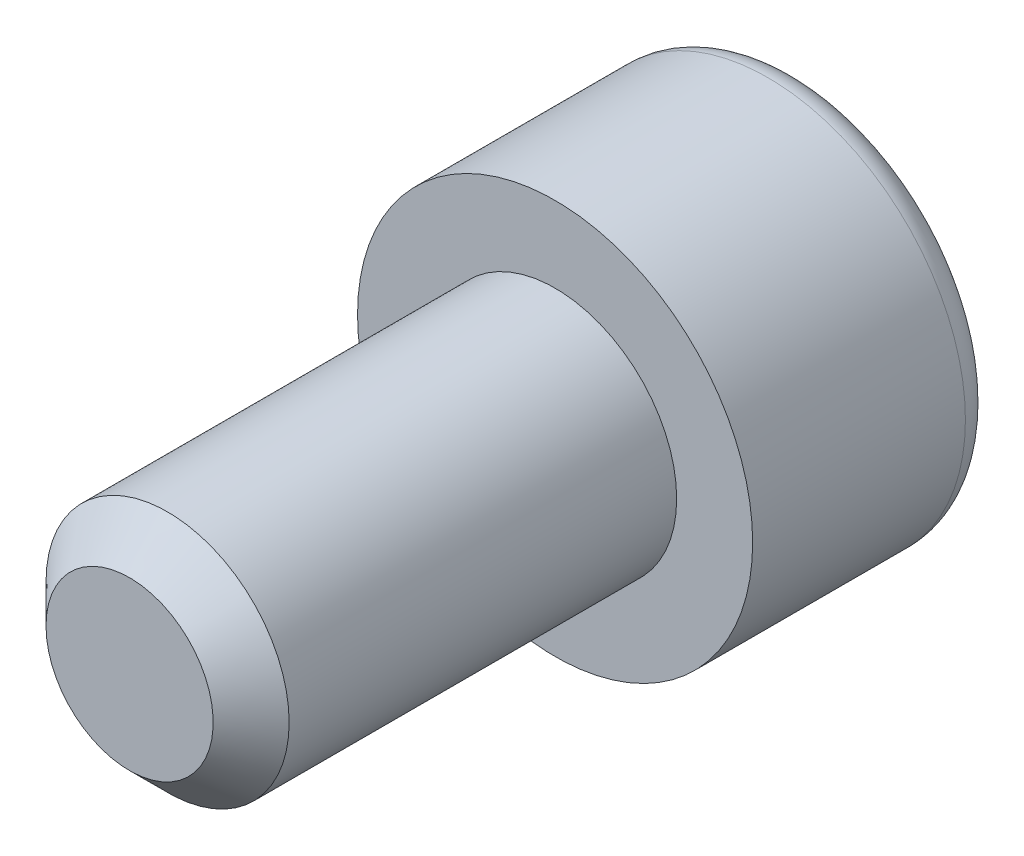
from build123d import *

# Parameters (mm, degrees)
ESQUISSE2_R             = 4
BASE_EXTRUSION_DEPTH    = 14
CHANFREIN2_SIZE         = 1.25
ESQUISSE8_R             = 6.5
BOSS_EXTRU_3_DEPTH      = 8
CONG_7_R                = 1
ENL_V_MAT_EXTRU_1_DEPTH = 6


with BuildPart() as part:
    # Esquisse2 → Base-Extrusion (new body)
    with BuildSketch(Plane.XY):
        with Locations(Location((0, 0, 0), (0, 0, 180))):
            Circle(ESQUISSE2_R)
    extrude(amount=BASE_EXTRUSION_DEPTH)

    # Chanfrein2
    chanfrein2_edges = [part.edges().sort_by_distance(p)[0] for p in [
        (4, 0, 14),
    ]]
    chamfer(chanfrein2_edges, length=CHANFREIN2_SIZE)

    # Esquisse8 → Boss.-Extru.3 (add)
    with BuildSketch(Plane(origin=(0, 0, 0), x_dir=(-1, 0, 0), z_dir=(0, 0, -1))):
        with Locations(Location((0, 0, 0), (0, 0, 180))):
            Circle(ESQUISSE8_R)
    extrude(amount=BOSS_EXTRU_3_DEPTH)

    # Cong_7
    cong_7_edges = [part.edges().sort_by_distance(p)[0] for p in [
        (-6.5, 0, -8),
    ]]
    fillet(cong_7_edges, radius=CONG_7_R)

    # Esquisse10 → Enl_v. mat.-Extru.1 (cut)
    with BuildSketch(Plane(origin=(0, 0, -8), x_dir=(-1, 0, 0), z_dir=(0, 0, -1))):
        Polygon((1.066696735, -3.295778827), (3.387576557, -0.724102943), (2.320879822, 2.571675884), (-1.066696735, 3.295778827), (-3.387576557, 0.724102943), (-2.320879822, -2.571675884), align=None)
    extrude(amount=-ENL_V_MAT_EXTRU_1_DEPTH, mode=Mode.SUBTRACT)


solid = part.part
